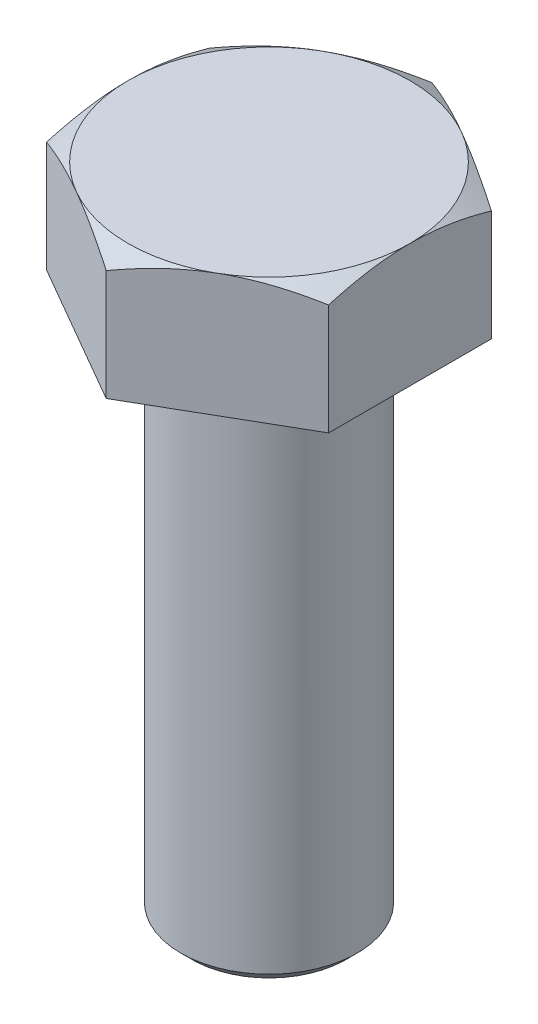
from build123d import *

# Parameters (mm, degrees)
BOSS_EXTRUDE1_DEPTH = 7
SKETCH2_R           = 5
BOSS_EXTRUDE2_DEPTH = 30
SKETCH3_OUTSIDE_W   = 262.428
SKETCH3_OUTSIDE_H   = 264.904
SKETCH3_OUTSIDE_R   = 8
CUT_EXTRUDE1_DEPTH  = 68
CUT_EXTRUDE1_DRAFT  = -60
SKETCH4_OUTSIDE_W   = 162.868
SKETCH4_OUTSIDE_H   = 165.344
SKETCH4_OUTSIDE_R   = 4.375
CUT_EXTRUDE2_DEPTH  = 68
CUT_EXTRUDE2_DRAFT  = -45


with BuildPart() as part:
    # Sketch1 → Boss-Extrude1 (new body)
    with BuildSketch(Plane(origin=(0, 0, 0), x_dir=(1, 0, 0), z_dir=(0, 1, 0))):
        Polygon((0, 9.237604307), (-8, 4.618802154), (-8, -4.618802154), (0, -9.237604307), (8, -4.618802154), (8, 4.618802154), align=None)
    extrude(amount=BOSS_EXTRUDE1_DEPTH)

    # Sketch2 → Boss-Extrude2 (add)
    with BuildSketch(Plane.XZ):
        with Locations(Location((0, 0, 0), (0, 0, 90))):
            Circle(SKETCH2_R)
    extrude(amount=BOSS_EXTRUDE2_DEPTH)


with BuildPart() as cut_extrude1_tool:
    # Sketch3 outside → Cut-Extrude1 (with draft: the straight prism first)
    with BuildSketch(Plane(origin=(0, 7, 0), x_dir=(1, 0, 0), z_dir=(0, 1, 0))):
        Rectangle(SKETCH3_OUTSIDE_W, SKETCH3_OUTSIDE_H)
        Circle(SKETCH3_OUTSIDE_R, mode=Mode.SUBTRACT)
    extrude(amount=-CUT_EXTRUDE1_DEPTH)
    # Cut-Extrude1: the draft: its side faces are tilted about the plane it starts from
    cut_extrude1_sides = [cut_extrude1_tool.faces().sort_by_distance(p)[0] for p in [
        (0, -27, 132.452),
        (131.214, -27, 0),
        (0, -27, -132.452),
        (-131.214, -27, 0),
        (-8, -27, 0),
    ]]
    draft(cut_extrude1_sides, Plane(origin=(0, 7, 0), x_dir=(1, 0, 0), z_dir=(0, 1, 0)), CUT_EXTRUDE1_DRAFT)


with BuildPart() as part_1:
    add(part.part)

    # Cut-Extrude1: cut by cut_extrude1_tool
    add(cut_extrude1_tool.part, mode=Mode.SUBTRACT)


with BuildPart() as cut_extrude2_tool:
    # Sketch4 outside → Cut-Extrude2 (with draft: the straight prism first)
    with BuildSketch(Plane.XZ.offset(30)):
        Rectangle(SKETCH4_OUTSIDE_W, SKETCH4_OUTSIDE_H)
        Circle(SKETCH4_OUTSIDE_R, mode=Mode.SUBTRACT)
    extrude(amount=-CUT_EXTRUDE2_DEPTH)
    # Cut-Extrude2: the draft: its side faces are tilted about the plane it starts from
    cut_extrude2_sides = [cut_extrude2_tool.faces().sort_by_distance(p)[0] for p in [
        (0, 4, -82.672),
        (81.434, 4, 0),
        (0, 4, 82.672),
        (-81.434, 4, 0),
        (-4.375, 4, 0),
    ]]
    draft(cut_extrude2_sides, Plane.XZ.offset(30), CUT_EXTRUDE2_DRAFT)


with BuildPart() as part_2:
    add(part_1.part)

    # Cut-Extrude2: cut by cut_extrude2_tool
    add(cut_extrude2_tool.part, mode=Mode.SUBTRACT)


solid = part_2.part
